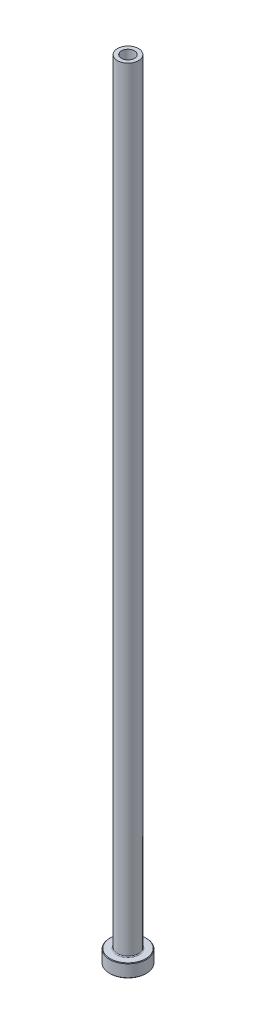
ISO-10303-21;
HEADER;
FILE_DESCRIPTION(('STEP AP214'),'2;1');
FILE_NAME('part.step','',(''),(''),'','','');
FILE_SCHEMA(('AUTOMOTIVE_DESIGN { 1 0 10303 214 1 1 1 1 }'));
ENDSEC;
DATA;
#1=APPLICATION_CONTEXT('core data for automotive mechanical design processes');
#2=APPLICATION_PROTOCOL_DEFINITION('international standard','automotive_design',2000,#1);
#3=PRODUCT_CONTEXT('',#1,'mechanical');
#4=PRODUCT('Part','Part','',(#3));
#5=PRODUCT_RELATED_PRODUCT_CATEGORY('part','',(#4));
#6=PRODUCT_DEFINITION_FORMATION('','',#4);
#7=PRODUCT_DEFINITION_CONTEXT('part definition',#1,'design');
#8=PRODUCT_DEFINITION('design','',#6,#7);
#9=PRODUCT_DEFINITION_SHAPE('','',#8);
#10=(LENGTH_UNIT() NAMED_UNIT(*) SI_UNIT(.MILLI.,.METRE.));
#11=(NAMED_UNIT(*) PLANE_ANGLE_UNIT() SI_UNIT($,.RADIAN.));
#12=(NAMED_UNIT(*) SI_UNIT($,.STERADIAN.) SOLID_ANGLE_UNIT());
#13=UNCERTAINTY_MEASURE_WITH_UNIT(LENGTH_MEASURE(1.E-05),#10,'distance_accuracy_value','');
#14=(GEOMETRIC_REPRESENTATION_CONTEXT(3) GLOBAL_UNCERTAINTY_ASSIGNED_CONTEXT((#13)) GLOBAL_UNIT_ASSIGNED_CONTEXT((#10,
#11,#12)) REPRESENTATION_CONTEXT('',''));
#15=CARTESIAN_POINT('',(0.,0.,0.));
#16=DIRECTION('',(0.,0.,1.));
#17=DIRECTION('',(1.,0.,0.));
#18=AXIS2_PLACEMENT_3D('',#15,#16,#17);
#19=CARTESIAN_POINT('',(0.,92.1876809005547,0.));
#20=DIRECTION('',(0.,1.,0.));
#21=DIRECTION('',(0.,0.,1.));
#22=AXIS2_PLACEMENT_3D('',#19,#20,#21);
#23=CYLINDRICAL_SURFACE('',#22,2.50000000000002);
#24=CARTESIAN_POINT('',(0.,300.,0.));
#25=DIRECTION('',(0.,1.,0.));
#26=DIRECTION('',(0.,0.,1.));
#27=AXIS2_PLACEMENT_3D('',#24,#25,#26);
#28=CIRCLE('',#27,2.50000000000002);
#29=CARTESIAN_POINT('',(0.,300.,2.50000000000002));
#30=VERTEX_POINT('',#29);
#31=EDGE_CURVE('E62',#30,#30,#28,.T.);
#32=ORIENTED_EDGE('',*,*,#31,.T.);
#33=EDGE_LOOP('',(#32));
#34=FACE_BOUND('',#33,.T.);
#35=CARTESIAN_POINT('',(0.,255.,0.));
#36=DIRECTION('',(0.,1.,0.));
#37=DIRECTION('',(0.,0.,1.));
#38=AXIS2_PLACEMENT_3D('',#35,#36,#37);
#39=CIRCLE('',#38,2.50000000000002);
#40=CARTESIAN_POINT('',(0.,255.,2.50000000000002));
#41=VERTEX_POINT('',#40);
#42=EDGE_CURVE('E71',#41,#41,#39,.T.);
#43=ORIENTED_EDGE('',*,*,#42,.F.);
#44=EDGE_LOOP('',(#43));
#45=FACE_BOUND('',#44,.T.);
#46=ADVANCED_FACE('F30',(#34,#45),#23,.F.);
#47=CARTESIAN_POINT('',(-2.50000000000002,300.,0.));
#48=DIRECTION('',(0.,1.,0.));
#49=DIRECTION('',(0.,0.,1.));
#50=AXIS2_PLACEMENT_3D('',#47,#48,#49);
#51=PLANE('',#50);
#52=CARTESIAN_POINT('',(0.,300.,0.));
#53=DIRECTION('',(0.,1.,0.));
#54=DIRECTION('',(0.,0.,1.));
#55=AXIS2_PLACEMENT_3D('',#52,#53,#54);
#56=CIRCLE('',#55,4.00000000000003);
#57=CARTESIAN_POINT('',(0.,300.,4.00000000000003));
#58=VERTEX_POINT('',#57);
#59=EDGE_CURVE('E65',#58,#58,#56,.T.);
#60=ORIENTED_EDGE('',*,*,#59,.T.);
#61=EDGE_LOOP('',(#60));
#62=FACE_BOUND('',#61,.T.);
#63=ORIENTED_EDGE('',*,*,#31,.F.);
#64=EDGE_LOOP('',(#63));
#65=FACE_BOUND('',#64,.T.);
#66=ADVANCED_FACE('F79',(#62,#65),#51,.T.);
#67=CARTESIAN_POINT('',(0.,92.1876809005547,0.));
#68=DIRECTION('',(0.,1.,0.));
#69=DIRECTION('',(0.,0.,1.));
#70=AXIS2_PLACEMENT_3D('',#67,#68,#69);
#71=CYLINDRICAL_SURFACE('',#70,4.00000000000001);
#72=CARTESIAN_POINT('',(0.,5.3,0.));
#73=DIRECTION('',(0.,1.,0.));
#74=DIRECTION('',(0.,0.,1.));
#75=AXIS2_PLACEMENT_3D('',#72,#73,#74);
#76=CIRCLE('',#75,4.00000000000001);
#77=CARTESIAN_POINT('',(0.,5.3,4.00000000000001));
#78=VERTEX_POINT('',#77);
#79=EDGE_CURVE('E59',#78,#78,#76,.T.);
#80=ORIENTED_EDGE('',*,*,#79,.T.);
#81=EDGE_LOOP('',(#80));
#82=FACE_BOUND('',#81,.T.);
#83=ORIENTED_EDGE('',*,*,#59,.F.);
#84=EDGE_LOOP('',(#83));
#85=FACE_BOUND('',#84,.T.);
#86=ADVANCED_FACE('F85',(#82,#85),#71,.T.);
#87=CARTESIAN_POINT('',(-3.99999999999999,5.,0.));
#88=DIRECTION('',(0.,1.,0.));
#89=DIRECTION('',(0.,0.,1.));
#90=AXIS2_PLACEMENT_3D('',#87,#88,#89);
#91=PLANE('',#90);
#92=CARTESIAN_POINT('',(0.,5.,0.));
#93=DIRECTION('',(0.,1.,0.));
#94=DIRECTION('',(0.,0.,1.));
#95=AXIS2_PLACEMENT_3D('',#92,#93,#94);
#96=CIRCLE('',#95,6.79999999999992);
#97=CARTESIAN_POINT('',(0.,5.,6.79999999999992));
#98=VERTEX_POINT('',#97);
#99=EDGE_CURVE('E53',#98,#98,#96,.T.);
#100=ORIENTED_EDGE('',*,*,#99,.T.);
#101=EDGE_LOOP('',(#100));
#102=FACE_BOUND('',#101,.T.);
#103=CARTESIAN_POINT('',(0.,5.,0.));
#104=DIRECTION('',(0.,1.,0.));
#105=DIRECTION('',(0.,0.,1.));
#106=AXIS2_PLACEMENT_3D('',#103,#104,#105);
#107=CIRCLE('',#106,4.30000000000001);
#108=CARTESIAN_POINT('',(0.,5.,4.30000000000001));
#109=VERTEX_POINT('',#108);
#110=EDGE_CURVE('E56',#109,#109,#107,.F.);
#111=ORIENTED_EDGE('',*,*,#110,.T.);
#112=EDGE_LOOP('',(#111));
#113=FACE_BOUND('',#112,.T.);
#114=ADVANCED_FACE('F111',(#102,#113),#91,.T.);
#115=CARTESIAN_POINT('',(0.,92.1876809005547,0.));
#116=DIRECTION('',(0.,1.,0.));
#117=DIRECTION('',(0.,0.,1.));
#118=AXIS2_PLACEMENT_3D('',#115,#116,#117);
#119=CYLINDRICAL_SURFACE('',#118,6.99999999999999);
#120=CARTESIAN_POINT('',(0.,4.79999999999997,0.));
#121=DIRECTION('',(0.,1.,0.));
#122=DIRECTION('',(0.,0.,1.));
#123=AXIS2_PLACEMENT_3D('',#120,#121,#122);
#124=CIRCLE('',#123,6.99999999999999);
#125=CARTESIAN_POINT('',(0.,4.79999999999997,6.99999999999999));
#126=VERTEX_POINT('',#125);
#127=EDGE_CURVE('E45',#126,#126,#124,.F.);
#128=ORIENTED_EDGE('',*,*,#127,.T.);
#129=EDGE_LOOP('',(#128));
#130=FACE_BOUND('',#129,.T.);
#131=CARTESIAN_POINT('',(0.,0.20000000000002,0.));
#132=DIRECTION('',(0.,-1.,0.));
#133=DIRECTION('',(0.,0.,-1.));
#134=AXIS2_PLACEMENT_3D('',#131,#132,#133);
#135=CIRCLE('',#134,6.99999999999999);
#136=CARTESIAN_POINT('',(0.,0.20000000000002,-6.99999999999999));
#137=VERTEX_POINT('',#136);
#138=EDGE_CURVE('E50',#137,#137,#135,.F.);
#139=ORIENTED_EDGE('',*,*,#138,.T.);
#140=EDGE_LOOP('',(#139));
#141=FACE_BOUND('',#140,.T.);
#142=ADVANCED_FACE('F108',(#130,#141),#119,.T.);
#143=CARTESIAN_POINT('',(-6.99999999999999,0.,0.));
#144=DIRECTION('',(0.,-1.,0.));
#145=DIRECTION('',(0.,0.,-1.));
#146=AXIS2_PLACEMENT_3D('',#143,#144,#145);
#147=PLANE('',#146);
#148=CARTESIAN_POINT('',(0.,0.,0.));
#149=DIRECTION('',(0.,-1.,0.));
#150=DIRECTION('',(0.,0.,-1.));
#151=AXIS2_PLACEMENT_3D('',#148,#149,#150);
#152=CIRCLE('',#151,3.25);
#153=CARTESIAN_POINT('',(0.,0.,-3.25));
#154=VERTEX_POINT('',#153);
#155=EDGE_CURVE('E37',#154,#154,#152,.F.);
#156=ORIENTED_EDGE('',*,*,#155,.T.);
#157=EDGE_LOOP('',(#156));
#158=FACE_BOUND('',#157,.T.);
#159=CARTESIAN_POINT('',(0.,0.,0.));
#160=DIRECTION('',(0.,-1.,0.));
#161=DIRECTION('',(0.,0.,-1.));
#162=AXIS2_PLACEMENT_3D('',#159,#160,#161);
#163=CIRCLE('',#162,6.79999999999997);
#164=CARTESIAN_POINT('',(0.,0.,-6.79999999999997));
#165=VERTEX_POINT('',#164);
#166=EDGE_CURVE('E41',#165,#165,#163,.T.);
#167=ORIENTED_EDGE('',*,*,#166,.T.);
#168=EDGE_LOOP('',(#167));
#169=FACE_BOUND('',#168,.T.);
#170=ADVANCED_FACE('F110',(#158,#169),#147,.T.);
#171=CARTESIAN_POINT('',(0.,92.1876809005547,0.));
#172=DIRECTION('',(0.,1.,0.));
#173=DIRECTION('',(0.,0.,1.));
#174=AXIS2_PLACEMENT_3D('',#171,#172,#173);
#175=CYLINDRICAL_SURFACE('',#174,2.75000000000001);
#176=CARTESIAN_POINT('',(0.,0.499999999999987,0.));
#177=DIRECTION('',(0.,-1.,0.));
#178=DIRECTION('',(0.,0.,-1.));
#179=AXIS2_PLACEMENT_3D('',#176,#177,#178);
#180=CIRCLE('',#179,2.75000000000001);
#181=CARTESIAN_POINT('',(0.,0.499999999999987,-2.75000000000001));
#182=VERTEX_POINT('',#181);
#183=EDGE_CURVE('E10',#182,#182,#180,.T.);
#184=ORIENTED_EDGE('',*,*,#183,.T.);
#185=EDGE_LOOP('',(#184));
#186=FACE_BOUND('',#185,.T.);
#187=CARTESIAN_POINT('',(0.,243.,0.));
#188=DIRECTION('',(0.,1.,0.));
#189=DIRECTION('',(0.,0.,1.));
#190=AXIS2_PLACEMENT_3D('',#187,#188,#189);
#191=CIRCLE('',#190,2.75000000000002);
#192=CARTESIAN_POINT('',(0.,243.,2.75000000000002));
#193=VERTEX_POINT('',#192);
#194=EDGE_CURVE('E68',#193,#193,#191,.T.);
#195=ORIENTED_EDGE('',*,*,#194,.T.);
#196=EDGE_LOOP('',(#195));
#197=FACE_BOUND('',#196,.T.);
#198=ADVANCED_FACE('F118',(#186,#197),#175,.F.);
#199=CARTESIAN_POINT('',(0.,243.,0.));
#200=DIRECTION('',(0.,-1.,0.));
#201=DIRECTION('',(0.,0.,-1.));
#202=AXIS2_PLACEMENT_3D('',#199,#200,#201);
#203=CONICAL_SURFACE('',#202,2.75000000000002,0.0208303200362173);
#204=ORIENTED_EDGE('',*,*,#42,.T.);
#205=EDGE_LOOP('',(#204));
#206=FACE_BOUND('',#205,.T.);
#207=ORIENTED_EDGE('',*,*,#194,.F.);
#208=EDGE_LOOP('',(#207));
#209=FACE_BOUND('',#208,.T.);
#210=ADVANCED_FACE('F75',(#206,#209),#203,.F.);
#211=CARTESIAN_POINT('',(0.,5.3,0.));
#212=DIRECTION('',(0.,1.,0.));
#213=DIRECTION('',(0.,0.,1.));
#214=AXIS2_PLACEMENT_3D('',#211,#212,#213);
#215=TOROIDAL_SURFACE('',#214,4.30000000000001,0.3);
#216=ORIENTED_EDGE('',*,*,#110,.F.);
#217=EDGE_LOOP('',(#216));
#218=FACE_BOUND('',#217,.T.);
#219=ORIENTED_EDGE('',*,*,#79,.F.);
#220=EDGE_LOOP('',(#219));
#221=FACE_BOUND('',#220,.T.);
#222=ADVANCED_FACE('F90',(#218,#221),#215,.F.);
#223=CARTESIAN_POINT('',(0.,5.,0.));
#224=DIRECTION('',(0.,-1.,0.));
#225=DIRECTION('',(0.,0.,-1.));
#226=AXIS2_PLACEMENT_3D('',#223,#224,#225);
#227=CONICAL_SURFACE('',#226,6.79999999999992,0.785398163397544);
#228=ORIENTED_EDGE('',*,*,#127,.F.);
#229=EDGE_LOOP('',(#228));
#230=FACE_BOUND('',#229,.T.);
#231=ORIENTED_EDGE('',*,*,#99,.F.);
#232=EDGE_LOOP('',(#231));
#233=FACE_BOUND('',#232,.T.);
#234=ADVANCED_FACE('F93',(#230,#233),#227,.T.);
#235=CARTESIAN_POINT('',(0.,0.20000000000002,0.));
#236=DIRECTION('',(0.,1.,0.));
#237=DIRECTION('',(0.,0.,1.));
#238=AXIS2_PLACEMENT_3D('',#235,#236,#237);
#239=CONICAL_SURFACE('',#238,6.99999999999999,0.78539816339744);
#240=ORIENTED_EDGE('',*,*,#166,.F.);
#241=EDGE_LOOP('',(#240));
#242=FACE_BOUND('',#241,.T.);
#243=ORIENTED_EDGE('',*,*,#138,.F.);
#244=EDGE_LOOP('',(#243));
#245=FACE_BOUND('',#244,.T.);
#246=ADVANCED_FACE('F96',(#242,#245),#239,.T.);
#247=CARTESIAN_POINT('',(0.,0.,0.));
#248=DIRECTION('',(0.,-1.,0.));
#249=DIRECTION('',(0.,0.,-1.));
#250=AXIS2_PLACEMENT_3D('',#247,#248,#249);
#251=CONICAL_SURFACE('',#250,3.25,0.785398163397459);
#252=ORIENTED_EDGE('',*,*,#183,.F.);
#253=EDGE_LOOP('',(#252));
#254=FACE_BOUND('',#253,.T.);
#255=ORIENTED_EDGE('',*,*,#155,.F.);
#256=EDGE_LOOP('',(#255));
#257=FACE_BOUND('',#256,.T.);
#258=ADVANCED_FACE('F32',(#254,#257),#251,.F.);
#259=CLOSED_SHELL('',(#46,#66,#86,#114,#142,#170,#198,#210,#222,#234,#246,#258));
#260=MANIFOLD_SOLID_BREP('B2',#259);
#261=ADVANCED_BREP_SHAPE_REPRESENTATION('',(#18,#260),#14);
#262=SHAPE_DEFINITION_REPRESENTATION(#9,#261);
ENDSEC;
END-ISO-10303-21;
